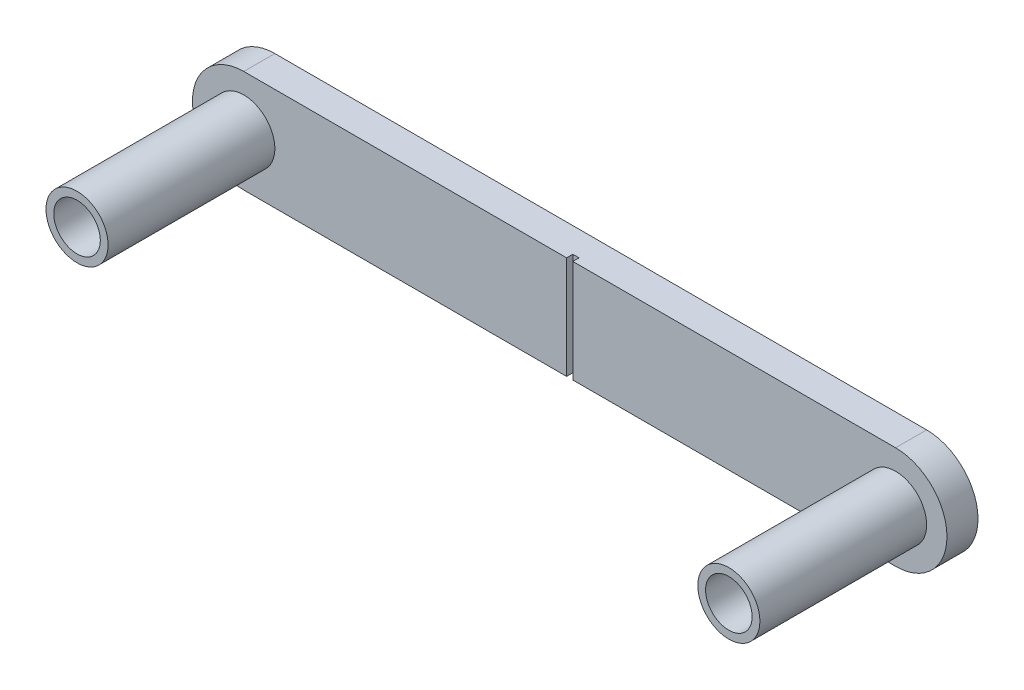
ISO-10303-21;
HEADER;
FILE_DESCRIPTION(('STEP AP214'),'2;1');
FILE_NAME('part.step','',(''),(''),'','','');
FILE_SCHEMA(('AUTOMOTIVE_DESIGN { 1 0 10303 214 1 1 1 1 }'));
ENDSEC;
DATA;
#1=APPLICATION_CONTEXT('core data for automotive mechanical design processes');
#2=APPLICATION_PROTOCOL_DEFINITION('international standard','automotive_design',2000,#1);
#3=PRODUCT_CONTEXT('',#1,'mechanical');
#4=PRODUCT('Part','Part','',(#3));
#5=PRODUCT_RELATED_PRODUCT_CATEGORY('part','',(#4));
#6=PRODUCT_DEFINITION_FORMATION('','',#4);
#7=PRODUCT_DEFINITION_CONTEXT('part definition',#1,'design');
#8=PRODUCT_DEFINITION('design','',#6,#7);
#9=PRODUCT_DEFINITION_SHAPE('','',#8);
#10=(LENGTH_UNIT() NAMED_UNIT(*) SI_UNIT(.MILLI.,.METRE.));
#11=(NAMED_UNIT(*) PLANE_ANGLE_UNIT() SI_UNIT($,.RADIAN.));
#12=(NAMED_UNIT(*) SI_UNIT($,.STERADIAN.) SOLID_ANGLE_UNIT());
#13=UNCERTAINTY_MEASURE_WITH_UNIT(LENGTH_MEASURE(1.E-05),#10,'distance_accuracy_value','');
#14=(GEOMETRIC_REPRESENTATION_CONTEXT(3) GLOBAL_UNCERTAINTY_ASSIGNED_CONTEXT((#13)) GLOBAL_UNIT_ASSIGNED_CONTEXT((#10,
#11,#12)) REPRESENTATION_CONTEXT('',''));
#15=CARTESIAN_POINT('',(0.,0.,0.));
#16=DIRECTION('',(0.,0.,1.));
#17=DIRECTION('',(1.,0.,0.));
#18=AXIS2_PLACEMENT_3D('',#15,#16,#17);
#19=CARTESIAN_POINT('',(290.595340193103,142.140968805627,-53.5673068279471));
#20=DIRECTION('',(0.,0.,-1.));
#21=DIRECTION('',(-1.,0.,0.));
#22=AXIS2_PLACEMENT_3D('',#19,#20,#21);
#23=PLANE('',#22);
#24=CARTESIAN_POINT('',(290.595340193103,142.140968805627,-53.5673068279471));
#25=DIRECTION('',(0.,0.,-1.));
#26=DIRECTION('',(-1.,0.,0.));
#27=AXIS2_PLACEMENT_3D('',#24,#25,#26);
#28=CIRCLE('',#27,3.99999999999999);
#29=CARTESIAN_POINT('',(286.595340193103,142.140968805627,-53.5673068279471));
#30=VERTEX_POINT('',#29);
#31=EDGE_CURVE('E147',#30,#30,#28,.F.);
#32=ORIENTED_EDGE('',*,*,#31,.F.);
#33=EDGE_LOOP('',(#32));
#34=FACE_BOUND('',#33,.T.);
#35=DIRECTION('',(1.,0.,0.));
#36=VECTOR('',#35,1.);
#37=CARTESIAN_POINT('',(206.595340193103,148.758480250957,-53.5673068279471));
#38=LINE('',#37,#36);
#39=CARTESIAN_POINT('',(248.995340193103,148.758480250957,-53.5673068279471));
#40=VERTEX_POINT('',#39);
#41=CARTESIAN_POINT('',(290.595340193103,148.758480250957,-53.5673068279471));
#42=VERTEX_POINT('',#41);
#43=EDGE_CURVE('E110',#40,#42,#38,.T.);
#44=ORIENTED_EDGE('',*,*,#43,.F.);
#45=DIRECTION('',(0.,1.,0.));
#46=VECTOR('',#45,1.);
#47=CARTESIAN_POINT('',(248.995340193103,148.758480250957,-53.5673068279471));
#48=LINE('',#47,#46);
#49=CARTESIAN_POINT('',(248.995340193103,135.523457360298,-53.5673068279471));
#50=VERTEX_POINT('',#49);
#51=EDGE_CURVE('E97',#50,#40,#48,.T.);
#52=ORIENTED_EDGE('',*,*,#51,.F.);
#53=DIRECTION('',(-1.,0.,0.));
#54=VECTOR('',#53,1.);
#55=CARTESIAN_POINT('',(290.595340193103,135.523457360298,-53.5673068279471));
#56=LINE('',#55,#54);
#57=CARTESIAN_POINT('',(290.595340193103,135.523457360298,-53.5673068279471));
#58=VERTEX_POINT('',#57);
#59=EDGE_CURVE('E126',#58,#50,#56,.T.);
#60=ORIENTED_EDGE('',*,*,#59,.F.);
#61=CARTESIAN_POINT('',(290.595340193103,142.140968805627,-53.5673068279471));
#62=DIRECTION('',(0.,0.,-1.));
#63=DIRECTION('',(-1.,0.,0.));
#64=AXIS2_PLACEMENT_3D('',#61,#62,#63);
#65=CIRCLE('',#64,6.61751144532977);
#66=EDGE_CURVE('E120',#42,#58,#65,.T.);
#67=ORIENTED_EDGE('',*,*,#66,.F.);
#68=EDGE_LOOP('',(#44,#52,#60,#67));
#69=FACE_BOUND('',#68,.T.);
#70=ADVANCED_FACE('F32',(#34,#69),#23,.F.);
#71=CARTESIAN_POINT('',(248.195340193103,135.523457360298,-53.5673068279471));
#72=VERTEX_POINT('',#71);
#73=CARTESIAN_POINT('',(206.595340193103,135.523457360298,-53.5673068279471));
#74=VERTEX_POINT('',#73);
#75=EDGE_CURVE('E194',#72,#74,#56,.T.);
#76=ORIENTED_EDGE('',*,*,#75,.F.);
#77=DIRECTION('',(0.,-1.,0.));
#78=VECTOR('',#77,1.);
#79=CARTESIAN_POINT('',(248.195340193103,148.758480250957,-53.5673068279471));
#80=LINE('',#79,#78);
#81=CARTESIAN_POINT('',(248.195340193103,148.758480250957,-53.5673068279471));
#82=VERTEX_POINT('',#81);
#83=EDGE_CURVE('E104',#82,#72,#80,.T.);
#84=ORIENTED_EDGE('',*,*,#83,.F.);
#85=CARTESIAN_POINT('',(206.595340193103,148.758480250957,-53.5673068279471));
#86=VERTEX_POINT('',#85);
#87=EDGE_CURVE('E121',#86,#82,#38,.T.);
#88=ORIENTED_EDGE('',*,*,#87,.F.);
#89=CARTESIAN_POINT('',(206.595340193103,142.140968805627,-53.5673068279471));
#90=DIRECTION('',(0.,0.,-1.));
#91=DIRECTION('',(1.,0.,0.));
#92=AXIS2_PLACEMENT_3D('',#89,#90,#91);
#93=CIRCLE('',#92,6.61751144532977);
#94=EDGE_CURVE('E122',#74,#86,#93,.T.);
#95=ORIENTED_EDGE('',*,*,#94,.F.);
#96=EDGE_LOOP('',(#76,#84,#88,#95));
#97=FACE_BOUND('',#96,.T.);
#98=CARTESIAN_POINT('',(206.595340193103,142.140968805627,-53.5673068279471));
#99=DIRECTION('',(0.,0.,-1.));
#100=DIRECTION('',(-1.,0.,0.));
#101=AXIS2_PLACEMENT_3D('',#98,#99,#100);
#102=CIRCLE('',#101,4.);
#103=CARTESIAN_POINT('',(202.595340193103,142.140968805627,-53.5673068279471));
#104=VERTEX_POINT('',#103);
#105=EDGE_CURVE('E11',#104,#104,#102,.F.);
#106=ORIENTED_EDGE('',*,*,#105,.F.);
#107=EDGE_LOOP('',(#106));
#108=FACE_BOUND('',#107,.T.);
#109=ADVANCED_FACE('F155',(#97,#108),#23,.F.);
#110=CARTESIAN_POINT('',(290.595340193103,142.140968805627,-53.5673068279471));
#111=DIRECTION('',(0.,0.,1.));
#112=DIRECTION('',(1.,0.,0.));
#113=AXIS2_PLACEMENT_3D('',#110,#111,#112);
#114=CYLINDRICAL_SURFACE('',#113,3.99999999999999);
#115=ORIENTED_EDGE('',*,*,#31,.T.);
#116=EDGE_LOOP('',(#115));
#117=FACE_BOUND('',#116,.T.);
#118=CARTESIAN_POINT('',(290.595340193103,142.140968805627,-32.0753068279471));
#119=DIRECTION('',(0.,0.,1.));
#120=DIRECTION('',(1.,0.,0.));
#121=AXIS2_PLACEMENT_3D('',#118,#119,#120);
#122=CIRCLE('',#121,3.99999999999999);
#123=CARTESIAN_POINT('',(294.595340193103,142.140968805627,-32.0753068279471));
#124=VERTEX_POINT('',#123);
#125=EDGE_CURVE('E40',#124,#124,#122,.T.);
#126=ORIENTED_EDGE('',*,*,#125,.F.);
#127=EDGE_LOOP('',(#126));
#128=FACE_BOUND('',#127,.T.);
#129=ADVANCED_FACE('F34',(#117,#128),#114,.T.);
#130=CARTESIAN_POINT('',(290.595340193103,142.140968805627,-32.0753068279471));
#131=DIRECTION('',(0.,0.,1.));
#132=DIRECTION('',(1.,0.,0.));
#133=AXIS2_PLACEMENT_3D('',#130,#131,#132);
#134=PLANE('',#133);
#135=CARTESIAN_POINT('',(290.595340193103,142.140968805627,-32.0753068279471));
#136=DIRECTION('',(0.,0.,1.));
#137=DIRECTION('',(1.,0.,0.));
#138=AXIS2_PLACEMENT_3D('',#135,#136,#137);
#139=CIRCLE('',#138,3.00000000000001);
#140=CARTESIAN_POINT('',(293.595340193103,142.140968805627,-32.0753068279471));
#141=VERTEX_POINT('',#140);
#142=EDGE_CURVE('E259',#141,#141,#139,.T.);
#143=ORIENTED_EDGE('',*,*,#142,.F.);
#144=EDGE_LOOP('',(#143));
#145=FACE_BOUND('',#144,.T.);
#146=ORIENTED_EDGE('',*,*,#125,.T.);
#147=EDGE_LOOP('',(#146));
#148=FACE_BOUND('',#147,.T.);
#149=ADVANCED_FACE('F152',(#145,#148),#134,.T.);
#150=CARTESIAN_POINT('',(290.595340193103,142.140968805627,-57.5673068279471));
#151=DIRECTION('',(0.,0.,1.));
#152=DIRECTION('',(1.,0.,0.));
#153=AXIS2_PLACEMENT_3D('',#150,#151,#152);
#154=CYLINDRICAL_SURFACE('',#153,6.61751144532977);
#155=ORIENTED_EDGE('',*,*,#66,.T.);
#156=DIRECTION('',(0.,0.,1.));
#157=VECTOR('',#156,1.);
#158=CARTESIAN_POINT('',(290.595340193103,135.523457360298,-57.5673068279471));
#159=LINE('',#158,#157);
#160=CARTESIAN_POINT('',(290.595340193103,135.523457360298,-57.5673068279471));
#161=VERTEX_POINT('',#160);
#162=EDGE_CURVE('E144',#161,#58,#159,.T.);
#163=ORIENTED_EDGE('',*,*,#162,.F.);
#164=CARTESIAN_POINT('',(290.595340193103,142.140968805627,-57.5673068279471));
#165=DIRECTION('',(0.,0.,-1.));
#166=DIRECTION('',(-1.,0.,0.));
#167=AXIS2_PLACEMENT_3D('',#164,#165,#166);
#168=CIRCLE('',#167,6.61751144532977);
#169=CARTESIAN_POINT('',(290.595340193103,148.758480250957,-57.5673068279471));
#170=VERTEX_POINT('',#169);
#171=EDGE_CURVE('E125',#170,#161,#168,.T.);
#172=ORIENTED_EDGE('',*,*,#171,.F.);
#173=DIRECTION('',(0.,0.,1.));
#174=VECTOR('',#173,1.);
#175=CARTESIAN_POINT('',(290.595340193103,148.758480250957,-57.5673068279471));
#176=LINE('',#175,#174);
#177=EDGE_CURVE('E136',#170,#42,#176,.T.);
#178=ORIENTED_EDGE('',*,*,#177,.T.);
#179=EDGE_LOOP('',(#155,#163,#172,#178));
#180=FACE_BOUND('',#179,.T.);
#181=ADVANCED_FACE('F161',(#180),#154,.T.);
#182=CARTESIAN_POINT('',(290.595340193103,135.523457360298,-57.5673068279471));
#183=DIRECTION('',(0.,1.,0.));
#184=DIRECTION('',(0.,0.,1.));
#185=AXIS2_PLACEMENT_3D('',#182,#183,#184);
#186=PLANE('',#185);
#187=ORIENTED_EDGE('',*,*,#59,.T.);
#188=DIRECTION('',(0.,0.,-1.));
#189=VECTOR('',#188,1.);
#190=CARTESIAN_POINT('',(248.995340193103,135.523457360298,-57.5673068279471));
#191=LINE('',#190,#189);
#192=CARTESIAN_POINT('',(248.995340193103,135.523457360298,-54.3673068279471));
#193=VERTEX_POINT('',#192);
#194=EDGE_CURVE('E100',#50,#193,#191,.T.);
#195=ORIENTED_EDGE('',*,*,#194,.T.);
#196=DIRECTION('',(1.,0.,0.));
#197=VECTOR('',#196,1.);
#198=CARTESIAN_POINT('',(290.595340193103,135.523457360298,-54.3673068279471));
#199=LINE('',#198,#197);
#200=CARTESIAN_POINT('',(248.195340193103,135.523457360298,-54.3673068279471));
#201=VERTEX_POINT('',#200);
#202=EDGE_CURVE('E219',#201,#193,#199,.T.);
#203=ORIENTED_EDGE('',*,*,#202,.F.);
#204=DIRECTION('',(0.,0.,1.));
#205=VECTOR('',#204,1.);
#206=CARTESIAN_POINT('',(248.195340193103,135.523457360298,-57.5673068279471));
#207=LINE('',#206,#205);
#208=EDGE_CURVE('E222',#201,#72,#207,.T.);
#209=ORIENTED_EDGE('',*,*,#208,.T.);
#210=ORIENTED_EDGE('',*,*,#75,.T.);
#211=DIRECTION('',(0.,0.,1.));
#212=VECTOR('',#211,1.);
#213=CARTESIAN_POINT('',(206.595340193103,135.523457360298,-57.5673068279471));
#214=LINE('',#213,#212);
#215=CARTESIAN_POINT('',(206.595340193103,135.523457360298,-57.5673068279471));
#216=VERTEX_POINT('',#215);
#217=EDGE_CURVE('E141',#216,#74,#214,.T.);
#218=ORIENTED_EDGE('',*,*,#217,.F.);
#219=DIRECTION('',(-1.,0.,0.));
#220=VECTOR('',#219,1.);
#221=CARTESIAN_POINT('',(290.595340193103,135.523457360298,-57.5673068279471));
#222=LINE('',#221,#220);
#223=EDGE_CURVE('E131',#161,#216,#222,.T.);
#224=ORIENTED_EDGE('',*,*,#223,.F.);
#225=ORIENTED_EDGE('',*,*,#162,.T.);
#226=EDGE_LOOP('',(#187,#195,#203,#209,#210,#218,#224,#225));
#227=FACE_BOUND('',#226,.T.);
#228=ADVANCED_FACE('F183',(#227),#186,.F.);
#229=CARTESIAN_POINT('',(206.595340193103,142.140968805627,-57.5673068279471));
#230=DIRECTION('',(0.,0.,1.));
#231=DIRECTION('',(1.,0.,0.));
#232=AXIS2_PLACEMENT_3D('',#229,#230,#231);
#233=CYLINDRICAL_SURFACE('',#232,6.61751144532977);
#234=ORIENTED_EDGE('',*,*,#94,.T.);
#235=DIRECTION('',(0.,0.,1.));
#236=VECTOR('',#235,1.);
#237=CARTESIAN_POINT('',(206.595340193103,148.758480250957,-57.5673068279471));
#238=LINE('',#237,#236);
#239=CARTESIAN_POINT('',(206.595340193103,148.758480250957,-57.5673068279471));
#240=VERTEX_POINT('',#239);
#241=EDGE_CURVE('E138',#240,#86,#238,.T.);
#242=ORIENTED_EDGE('',*,*,#241,.F.);
#243=CARTESIAN_POINT('',(206.595340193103,142.140968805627,-57.5673068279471));
#244=DIRECTION('',(0.,0.,-1.));
#245=DIRECTION('',(1.,0.,0.));
#246=AXIS2_PLACEMENT_3D('',#243,#244,#245);
#247=CIRCLE('',#246,6.61751144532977);
#248=EDGE_CURVE('E133',#216,#240,#247,.T.);
#249=ORIENTED_EDGE('',*,*,#248,.F.);
#250=ORIENTED_EDGE('',*,*,#217,.T.);
#251=EDGE_LOOP('',(#234,#242,#249,#250));
#252=FACE_BOUND('',#251,.T.);
#253=ADVANCED_FACE('F180',(#252),#233,.T.);
#254=CARTESIAN_POINT('',(206.595340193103,148.758480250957,-57.5673068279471));
#255=DIRECTION('',(0.,-1.,0.));
#256=DIRECTION('',(0.,0.,-1.));
#257=AXIS2_PLACEMENT_3D('',#254,#255,#256);
#258=PLANE('',#257);
#259=DIRECTION('',(-1.,0.,0.));
#260=VECTOR('',#259,1.);
#261=CARTESIAN_POINT('',(248.195340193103,148.758480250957,-54.3673068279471));
#262=LINE('',#261,#260);
#263=CARTESIAN_POINT('',(248.995340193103,148.758480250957,-54.3673068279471));
#264=VERTEX_POINT('',#263);
#265=CARTESIAN_POINT('',(248.195340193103,148.758480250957,-54.3673068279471));
#266=VERTEX_POINT('',#265);
#267=EDGE_CURVE('E114',#264,#266,#262,.T.);
#268=ORIENTED_EDGE('',*,*,#267,.F.);
#269=DIRECTION('',(0.,0.,1.));
#270=VECTOR('',#269,1.);
#271=CARTESIAN_POINT('',(248.995340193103,148.758480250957,-54.3673068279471));
#272=LINE('',#271,#270);
#273=EDGE_CURVE('E47',#264,#40,#272,.T.);
#274=ORIENTED_EDGE('',*,*,#273,.T.);
#275=ORIENTED_EDGE('',*,*,#43,.T.);
#276=ORIENTED_EDGE('',*,*,#177,.F.);
#277=DIRECTION('',(1.,0.,0.));
#278=VECTOR('',#277,1.);
#279=CARTESIAN_POINT('',(206.595340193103,148.758480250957,-57.5673068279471));
#280=LINE('',#279,#278);
#281=EDGE_CURVE('E55',#240,#170,#280,.T.);
#282=ORIENTED_EDGE('',*,*,#281,.F.);
#283=ORIENTED_EDGE('',*,*,#241,.T.);
#284=ORIENTED_EDGE('',*,*,#87,.T.);
#285=DIRECTION('',(0.,0.,1.));
#286=VECTOR('',#285,1.);
#287=CARTESIAN_POINT('',(248.195340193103,148.758480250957,-54.3673068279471));
#288=LINE('',#287,#286);
#289=EDGE_CURVE('E115',#266,#82,#288,.T.);
#290=ORIENTED_EDGE('',*,*,#289,.F.);
#291=EDGE_LOOP('',(#268,#274,#275,#276,#282,#283,#284,#290));
#292=FACE_BOUND('',#291,.T.);
#293=ADVANCED_FACE('F109',(#292),#258,.F.);
#294=CARTESIAN_POINT('',(290.595340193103,142.140968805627,-57.5673068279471));
#295=DIRECTION('',(0.,0.,-1.));
#296=DIRECTION('',(-1.,0.,0.));
#297=AXIS2_PLACEMENT_3D('',#294,#295,#296);
#298=PLANE('',#297);
#299=CARTESIAN_POINT('',(290.595340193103,142.140968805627,-57.5673068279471));
#300=DIRECTION('',(0.,0.,1.));
#301=DIRECTION('',(1.,0.,0.));
#302=AXIS2_PLACEMENT_3D('',#299,#300,#301);
#303=CIRCLE('',#302,3.00000000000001);
#304=CARTESIAN_POINT('',(293.595340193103,142.140968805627,-57.5673068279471));
#305=VERTEX_POINT('',#304);
#306=EDGE_CURVE('E255',#305,#305,#303,.T.);
#307=ORIENTED_EDGE('',*,*,#306,.T.);
#308=EDGE_LOOP('',(#307));
#309=FACE_BOUND('',#308,.T.);
#310=CARTESIAN_POINT('',(206.595340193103,142.140968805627,-57.5673068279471));
#311=DIRECTION('',(0.,0.,1.));
#312=DIRECTION('',(1.,0.,0.));
#313=AXIS2_PLACEMENT_3D('',#310,#311,#312);
#314=CIRCLE('',#313,3.00000000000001);
#315=CARTESIAN_POINT('',(209.595340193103,142.140968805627,-57.5673068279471));
#316=VERTEX_POINT('',#315);
#317=EDGE_CURVE('E105',#316,#316,#314,.T.);
#318=ORIENTED_EDGE('',*,*,#317,.T.);
#319=EDGE_LOOP('',(#318));
#320=FACE_BOUND('',#319,.T.);
#321=ORIENTED_EDGE('',*,*,#171,.T.);
#322=ORIENTED_EDGE('',*,*,#223,.T.);
#323=ORIENTED_EDGE('',*,*,#248,.T.);
#324=ORIENTED_EDGE('',*,*,#281,.T.);
#325=EDGE_LOOP('',(#321,#322,#323,#324));
#326=FACE_BOUND('',#325,.T.);
#327=ADVANCED_FACE('F174',(#309,#320,#326),#298,.T.);
#328=CARTESIAN_POINT('',(206.595340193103,142.140968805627,-32.0753068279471));
#329=DIRECTION('',(0.,0.,-1.));
#330=DIRECTION('',(-1.,0.,0.));
#331=AXIS2_PLACEMENT_3D('',#328,#329,#330);
#332=CYLINDRICAL_SURFACE('',#331,4.);
#333=CARTESIAN_POINT('',(206.595340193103,142.140968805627,-32.0753068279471));
#334=DIRECTION('',(0.,0.,1.));
#335=DIRECTION('',(1.,0.,0.));
#336=AXIS2_PLACEMENT_3D('',#333,#334,#335);
#337=CIRCLE('',#336,4.);
#338=CARTESIAN_POINT('',(210.595340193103,142.140968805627,-32.0753068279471));
#339=VERTEX_POINT('',#338);
#340=EDGE_CURVE('E195',#339,#339,#337,.T.);
#341=ORIENTED_EDGE('',*,*,#340,.F.);
#342=EDGE_LOOP('',(#341));
#343=FACE_BOUND('',#342,.T.);
#344=ORIENTED_EDGE('',*,*,#105,.T.);
#345=EDGE_LOOP('',(#344));
#346=FACE_BOUND('',#345,.T.);
#347=ADVANCED_FACE('F172',(#343,#346),#332,.T.);
#348=CARTESIAN_POINT('',(206.595340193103,142.140968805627,-32.0753068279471));
#349=DIRECTION('',(0.,0.,1.));
#350=DIRECTION('',(1.,0.,0.));
#351=AXIS2_PLACEMENT_3D('',#348,#349,#350);
#352=PLANE('',#351);
#353=CARTESIAN_POINT('',(206.595340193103,142.140968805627,-32.0753068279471));
#354=DIRECTION('',(0.,0.,1.));
#355=DIRECTION('',(1.,0.,0.));
#356=AXIS2_PLACEMENT_3D('',#353,#354,#355);
#357=CIRCLE('',#356,3.00000000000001);
#358=CARTESIAN_POINT('',(209.595340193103,142.140968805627,-32.0753068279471));
#359=VERTEX_POINT('',#358);
#360=EDGE_CURVE('E250',#359,#359,#357,.T.);
#361=ORIENTED_EDGE('',*,*,#360,.F.);
#362=EDGE_LOOP('',(#361));
#363=FACE_BOUND('',#362,.T.);
#364=ORIENTED_EDGE('',*,*,#340,.T.);
#365=EDGE_LOOP('',(#364));
#366=FACE_BOUND('',#365,.T.);
#367=ADVANCED_FACE('F240',(#363,#366),#352,.T.);
#368=CARTESIAN_POINT('',(248.995340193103,148.758480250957,-54.3673068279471));
#369=DIRECTION('',(1.,0.,0.));
#370=DIRECTION('',(0.,0.,-1.));
#371=AXIS2_PLACEMENT_3D('',#368,#369,#370);
#372=PLANE('',#371);
#373=ORIENTED_EDGE('',*,*,#51,.T.);
#374=ORIENTED_EDGE('',*,*,#273,.F.);
#375=DIRECTION('',(0.,1.,0.));
#376=VECTOR('',#375,1.);
#377=CARTESIAN_POINT('',(248.995340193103,148.758480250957,-54.3673068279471));
#378=LINE('',#377,#376);
#379=EDGE_CURVE('E211',#193,#264,#378,.T.);
#380=ORIENTED_EDGE('',*,*,#379,.F.);
#381=ORIENTED_EDGE('',*,*,#194,.F.);
#382=EDGE_LOOP('',(#373,#374,#380,#381));
#383=FACE_BOUND('',#382,.T.);
#384=ADVANCED_FACE('F98',(#383),#372,.F.);
#385=CARTESIAN_POINT('',(248.195340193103,148.758480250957,-54.3673068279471));
#386=DIRECTION('',(-1.,0.,0.));
#387=DIRECTION('',(0.,0.,1.));
#388=AXIS2_PLACEMENT_3D('',#385,#386,#387);
#389=PLANE('',#388);
#390=DIRECTION('',(0.,-1.,0.));
#391=VECTOR('',#390,1.);
#392=CARTESIAN_POINT('',(248.195340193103,148.758480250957,-54.3673068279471));
#393=LINE('',#392,#391);
#394=EDGE_CURVE('E116',#266,#201,#393,.T.);
#395=ORIENTED_EDGE('',*,*,#394,.F.);
#396=ORIENTED_EDGE('',*,*,#289,.T.);
#397=ORIENTED_EDGE('',*,*,#83,.T.);
#398=ORIENTED_EDGE('',*,*,#208,.F.);
#399=EDGE_LOOP('',(#395,#396,#397,#398));
#400=FACE_BOUND('',#399,.T.);
#401=ADVANCED_FACE('F223',(#400),#389,.F.);
#402=CARTESIAN_POINT('',(248.995340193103,135.370413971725,-54.3673068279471));
#403=DIRECTION('',(0.,0.,1.));
#404=DIRECTION('',(1.,0.,0.));
#405=AXIS2_PLACEMENT_3D('',#402,#403,#404);
#406=PLANE('',#405);
#407=ORIENTED_EDGE('',*,*,#202,.T.);
#408=ORIENTED_EDGE('',*,*,#379,.T.);
#409=ORIENTED_EDGE('',*,*,#267,.T.);
#410=ORIENTED_EDGE('',*,*,#394,.T.);
#411=EDGE_LOOP('',(#407,#408,#409,#410));
#412=FACE_BOUND('',#411,.T.);
#413=ADVANCED_FACE('F225',(#412),#406,.T.);
#414=CARTESIAN_POINT('',(206.595340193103,142.140968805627,-57.5673068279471));
#415=DIRECTION('',(0.,0.,1.));
#416=DIRECTION('',(1.,0.,0.));
#417=AXIS2_PLACEMENT_3D('',#414,#415,#416);
#418=CYLINDRICAL_SURFACE('',#417,3.00000000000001);
#419=ORIENTED_EDGE('',*,*,#317,.F.);
#420=EDGE_LOOP('',(#419));
#421=FACE_BOUND('',#420,.T.);
#422=ORIENTED_EDGE('',*,*,#360,.T.);
#423=EDGE_LOOP('',(#422));
#424=FACE_BOUND('',#423,.T.);
#425=ADVANCED_FACE('F227',(#421,#424),#418,.F.);
#426=CARTESIAN_POINT('',(290.595340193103,142.140968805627,-57.5673068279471));
#427=DIRECTION('',(0.,0.,1.));
#428=DIRECTION('',(1.,0.,0.));
#429=AXIS2_PLACEMENT_3D('',#426,#427,#428);
#430=CYLINDRICAL_SURFACE('',#429,3.00000000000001);
#431=ORIENTED_EDGE('',*,*,#306,.F.);
#432=EDGE_LOOP('',(#431));
#433=FACE_BOUND('',#432,.T.);
#434=ORIENTED_EDGE('',*,*,#142,.T.);
#435=EDGE_LOOP('',(#434));
#436=FACE_BOUND('',#435,.T.);
#437=ADVANCED_FACE('F233',(#433,#436),#430,.F.);
#438=CLOSED_SHELL('',(#70,#109,#129,#149,#181,#228,#253,#293,#327,#347,#367,#384,#401,#413,#425,#437));
#439=MANIFOLD_SOLID_BREP('B2',#438);
#440=ADVANCED_BREP_SHAPE_REPRESENTATION('',(#18,#439),#14);
#441=SHAPE_DEFINITION_REPRESENTATION(#9,#440);
ENDSEC;
END-ISO-10303-21;
